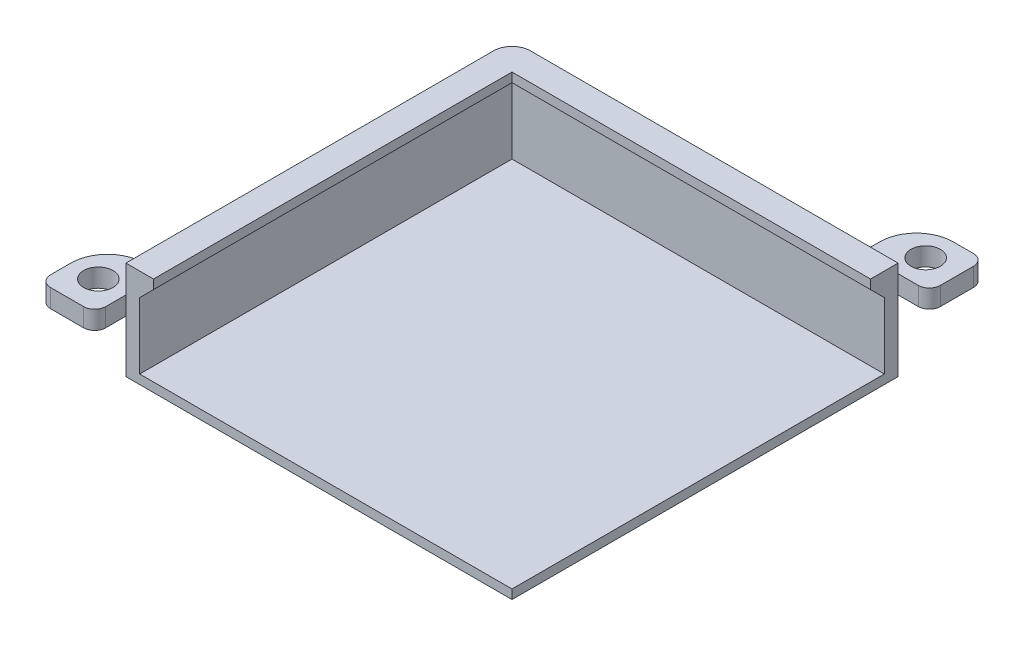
from build123d import *

# Parameters (mm, degrees)
SKETCH1_W            = 210
SKETCH1_H            = 210
BOSS_EXTRUDE1_DEPTH  = 5
SKETCH2_W            = 7.5
SKETCH2_H            = 36
BOSS_EXTRUDE2_DEPTH  = 210
SKETCH3_W            = 7.5
SKETCH3_H            = 36
BOSS_EXTRUDE3_DEPTH  = 210
FILLET1_R            = 10
SKETCH4_W            = 20
SKETCH4_H            = 10
BOSS_EXTRUDE4_DEPTH  = 10
BOSS_EXTRUDE9_DEPTH  = 10
SKETCH12_W           = 20
SKETCH12_H           = 10
BOSS_EXTRUDE10_DEPTH = 10
BOSS_EXTRUDE12_DEPTH = 10
SKETCH15_R           = 8
CUT_EXTRUDE4_DEPTH   = 195.762034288
SKETCH16_W           = 30
SKETCH16_H           = 10
CUT_EXTRUDE5_DEPTH   = 3
SKETCH17_W           = 30
SKETCH17_H           = 10
CUT_EXTRUDE6_DEPTH   = 3
SKETCH18_R           = 8
CUT_EXTRUDE7_DEPTH   = 197.982867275
FILLET4_R            = 6
BOSS_EXTRUDE13_DEPTH = 5
SCALE1_SCALE         = 0.9


with BuildPart() as part:
    # Sketch1 → Boss-Extrude1 (new body)
    with BuildSketch(Plane(origin=(0, 0, 0), x_dir=(1, 0, 0), z_dir=(0, 1, 0))):
        Rectangle(SKETCH1_W, SKETCH1_H)
    extrude(amount=BOSS_EXTRUDE1_DEPTH)

    # Sketch2 → Boss-Extrude2 (add)
    with BuildSketch(Plane.XY.offset(105)):
        with Locations((-101.25, 23)):
            Rectangle(SKETCH2_W, SKETCH2_H)
        Polygon((-105, 48.5), (-90, 48.5), (-97.5, 41), (-105, 41), align=None)
    extrude(amount=-BOSS_EXTRUDE2_DEPTH)

    # Sketch3 → Boss-Extrude3 (add)
    with BuildSketch(Plane(origin=(105, 0, 0), x_dir=(0, 0, -1), z_dir=(1, 0, 0))):
        with Locations((101.25, 23)):
            Rectangle(SKETCH3_W, SKETCH3_H)
        Polygon((97.5, 41), (90, 48.5), (105, 48.5), (105, 41), align=None)
    extrude(amount=-BOSS_EXTRUDE3_DEPTH)

    # Fillet1
    fillet1_edges = [part.edges().sort_by_distance(p)[0] for p in [
        (-105, 24.25, -105),
    ]]
    fillet(fillet1_edges, radius=FILLET1_R)

    # Sketch4 → Boss-Extrude4 (add)
    with BuildSketch(Plane(origin=(0, 0, -105), x_dir=(-1, 0, 0), z_dir=(0, 0, -1))):
        with Locations((-95, 43.5)):
            Rectangle(SKETCH4_W, SKETCH4_H)
    extrude(amount=BOSS_EXTRUDE4_DEPTH)

    # Sketch10 → Boss-Extrude9 (add)
    with BuildSketch(Plane(origin=(0, 48.5, 0), x_dir=(1, 0, 0), z_dir=(0, 1, 0))):
        Polygon((105, 135), (105, 115), (105, 105), (125, 105), (125, 135), align=None)
        with BuildLine():
            Line((105, 115), (105, 135))
            ThreePointArc((105, 135), (90.857864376, 129.142135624), (85, 115))
            Line((85, 115), (105, 115))
        make_face()
    extrude(amount=-BOSS_EXTRUDE9_DEPTH)

    # Sketch12 → Boss-Extrude10 (add)
    with BuildSketch(Plane.ZY.offset(105)):
        with Locations((95, 33.5)):
            Rectangle(SKETCH12_W, SKETCH12_H)
    extrude(amount=BOSS_EXTRUDE10_DEPTH)

    # Sketch14 → Boss-Extrude12 (add)
    with BuildSketch(Plane(origin=(0, 38.5, 0), x_dir=(1, 0, 0), z_dir=(0, 1, 0))):
        with BuildLine():
            ThreePointArc((-115, -85), (-129.142135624, -90.857864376), (-135, -105))
            Line((-135, -105), (-115, -105))
            Line((-115, -105), (-115, -85))
        make_face()
        Polygon((-105, -105), (-105, -125), (-135, -125), (-135, -105), (-115, -105), align=None)
    extrude(amount=-BOSS_EXTRUDE12_DEPTH)

    # Sketch15 → Cut-Extrude4 (cut, through all)
    with BuildSketch(Plane(origin=(0, 38.5, 0), x_dir=(1, 0, 0), z_dir=(0, 1, 0))):
        with Locations(Location((-120, -105, 0), (0, 0, 270))):
            Circle(SKETCH15_R)
    extrude(amount=-CUT_EXTRUDE4_DEPTH, mode=Mode.SUBTRACT)

    # Sketch16 → Cut-Extrude5 (cut)
    with BuildSketch(Plane.XY.offset(125)):
        with Locations((-120, 33.5)):
            Rectangle(SKETCH16_W, SKETCH16_H)
    extrude(amount=-CUT_EXTRUDE5_DEPTH, mode=Mode.SUBTRACT)

    # Sketch17 → Cut-Extrude6 (cut)
    with BuildSketch(Plane(origin=(125, 0, 0), x_dir=(0, 0, -1), z_dir=(1, 0, 0))):
        with Locations((120, 43.5)):
            Rectangle(SKETCH17_W, SKETCH17_H)
    extrude(amount=-CUT_EXTRUDE6_DEPTH, mode=Mode.SUBTRACT)

    # Sketch18 → Cut-Extrude7 (cut, through all)
    with BuildSketch(Plane(origin=(0, 48.5, 0), x_dir=(1, 0, 0), z_dir=(0, 1, 0))):
        with Locations(Location((105, 120, 0), (0, 0, 270))):
            Circle(SKETCH18_R)
    extrude(amount=-CUT_EXTRUDE7_DEPTH, mode=Mode.SUBTRACT)

    # Fillet4
    fillet4_edges = [part.edges().sort_by_distance(p)[0] for p in [
        (-135, 33.5, 122),
        (-105, 33.5, 122),
        (122, 43.5, -105),
        (122, 43.5, -135),
    ]]
    fillet(fillet4_edges, radius=FILLET4_R)

    # Sketch19 → Boss-Extrude13 (add)
    with BuildSketch(Plane(origin=(0, 48.5, 0), x_dir=(1, 0, 0), z_dir=(0, 1, 0))):
        with BuildLine():
            Line((-105, -105), (-90, -105))
            Line((-90, -105), (-90, 90))
            Line((-90, 90), (105, 90))
            Line((105, 90), (105, 105))
            Line((105, 105), (-95, 105))
            ThreePointArc((-95, 105), (-102.071067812, 102.071067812), (-105, 95))
            Line((-105, 95), (-105, -105))
        make_face()
    extrude(amount=BOSS_EXTRUDE13_DEPTH)


with BuildPart() as part_1:
    # Scale1: scaled about (-20.940373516, 16.538246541, -20.940373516)
    add(part.part.scale(SCALE1_SCALE).moved(Location((-2.094037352, 1.653824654, -2.094037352))))


solid = part_1.part
